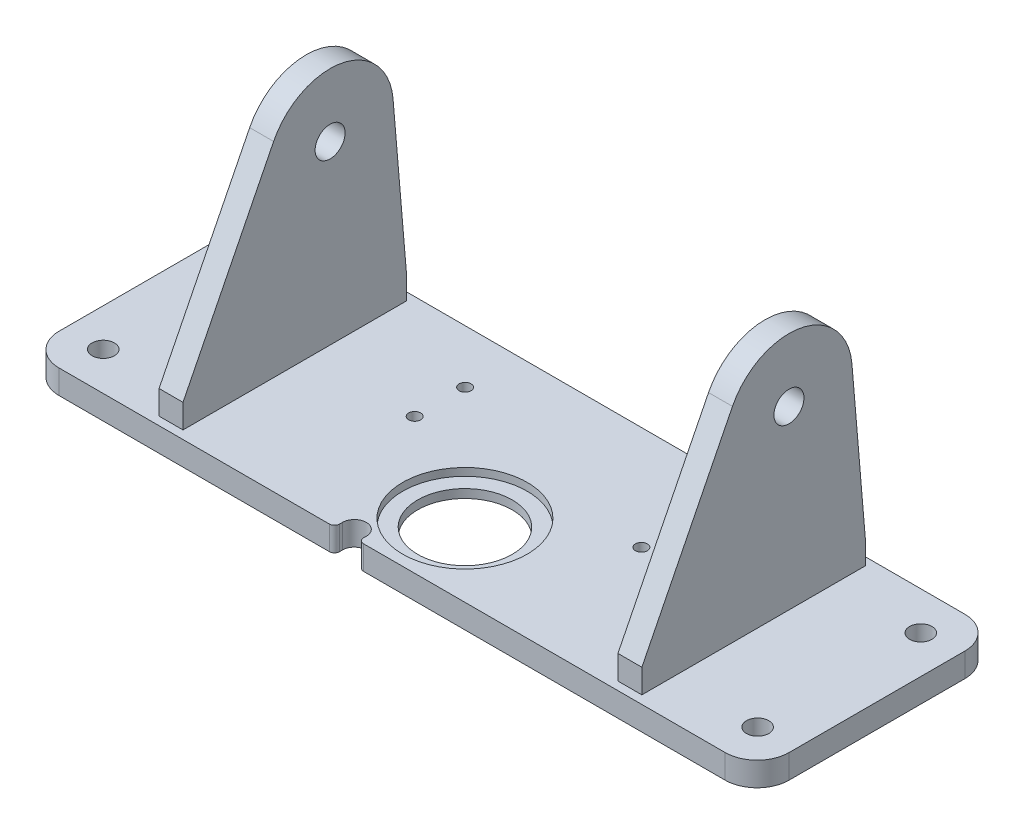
from build123d import *

# Parameters (mm, degrees)
SKETCH1_W                         = 290.3982
SKETCH1_H                         = 95.3516
SKETCH1_R                         = 18.796
MOUNTING_PLATE_DEPTH              = 9.525
SKETCH3_R                         = 4.445
SKETCH3_R_2                       = 2.3876
MOUNTING_HOLES_DEPTH              = 154.122454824
CORNER_RADII_R                    = 12.7
SKETCH5_W                         = 9.525
SKETCH5_H                         = 95.3516
UPRIGHT_TABS_DEPTH                = 95.25
UPRIGHT_TABS_2_DEPTH              = 95.25
SKETCH6_R                         = 5.969
POLE_BOLT_HOLE_REAM_TO_SIZE_DEPTH = 268.299261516
FILLET3_R                         = 2.032
SKETCH7_R                         = 24.765
SEAL_BELLOW_BOTTOM_CUT_DEPTH      = 3.048
SEAL_START                        = -3.048
SKETCH8_R                         = 24.765
SEAL_BELLOW_TOP_CUT_DEPTH         = 3.048


with BuildPart() as part:
    # Sketch1 → Mounting Plate (new body)
    with BuildSketch(Plane(origin=(0, 0, 0), x_dir=(1, 0, 0), z_dir=(0, 1, 0))):
        Rectangle(SKETCH1_W, SKETCH1_H)
        with Locations(Location((0, -18.7198, 0), (0, 0, 90))):
            Circle(SKETCH1_R, mode=Mode.SUBTRACT)
    extrude(amount=MOUNTING_PLATE_DEPTH)

    # Sketch3 → Mounting holes (cut, through all)
    with BuildSketch(Plane(origin=(0, 9.525, 0), x_dir=(1, 0, 0), z_dir=(0, 1, 0))):
        with Locations(Location((-130.175, 32.4612, 0), (0, 0, 270))):
            Circle(SKETCH3_R)
        with Locations(Location((130.175, 32.4612, 0), (0, 0, 270))):
            Circle(SKETCH3_R)
        with Locations(Location((130.175, -32.4612, 0), (0, 0, 270))):
            Circle(SKETCH3_R)
        with Locations(Location((-130.175, -32.4612, 0), (0, 0, 270))):
            Circle(SKETCH3_R)
        with Locations(Location((45.10405, 26.4414, 0), (0, 0, 270))):
            Circle(SKETCH3_R_2)
        with Locations(Location((45.10405, 6.3754, 0), (0, 0, 270))):
            Circle(SKETCH3_R_2)
        with Locations(Location((-45.10405, 6.3754, 0), (0, 0, 270))):
            Circle(SKETCH3_R_2)
        with Locations(Location((-45.10405, 26.4414, 0), (0, 0, 270))):
            Circle(SKETCH3_R_2)
        with BuildLine():
            Line((-22.9616, -44.5008), (-22.9616, -47.6758))
            Line((-22.9616, -47.6758), (-13.4366, -47.6758))
            Line((-13.4366, -47.6758), (-13.4366, -44.5008))
            ThreePointArc((-13.4366, -44.5008), (-18.1991, -39.7383), (-22.9616, -44.5008))
        make_face()
    extrude(amount=-MOUNTING_HOLES_DEPTH, mode=Mode.SUBTRACT)

    # corner radii
    corner_radii_edges = [part.edges().sort_by_distance(p)[0] for p in [
        (145.1991, 4.7625, 47.6758),
        (-145.1991, 4.7625, 47.6758),
        (-145.1991, 4.7625, -47.6758),
        (145.1991, 4.7625, -47.6758),
    ]]
    fillet(corner_radii_edges, radius=CORNER_RADII_R)

    # Fillet3
    fillet3_edges = [part.edges().sort_by_distance(p)[0] for p in [
        (-13.4366, 4.7625, 47.6758),
        (-22.9616, 4.7625, 47.6758),
    ]]
    fillet(fillet3_edges, radius=FILLET3_R)

    # Sketch7 → seal bellow bottom cut (cut)
    with BuildSketch(Plane.XZ):
        with Locations(Location((0, 18.7198, 0), (0, 0, 270))):
            Circle(SKETCH7_R)
    extrude(amount=-SEAL_BELLOW_BOTTOM_CUT_DEPTH, mode=Mode.SUBTRACT)

    # Sketch8 → seal bellow top cut (cut)
    with BuildSketch(Plane(origin=(0, 9.525, 0), x_dir=(1, 0, 0), z_dir=(0, 1, 0)).offset(SEAL_START)):
        with Locations(Location((0, -18.7198, 0), (0, 0, 90))):
            Circle(SKETCH8_R)
    extrude(amount=SEAL_BELLOW_TOP_CUT_DEPTH, mode=Mode.SUBTRACT)


with BuildPart() as body_2:
    # Sketch5 → Upright tabs (new body)
    with BuildSketch(Plane(origin=(0, 9.525, 0), x_dir=(1, 0, 0), z_dir=(0, 1, 0))):
        with Locations((-91.28125, 0)):
            Rectangle(SKETCH5_W, SKETCH5_H)
    extrude(amount=UPRIGHT_TABS_DEPTH)


with BuildPart() as body_3:
    # Sketch5 → Upright tabs 2 (new body)
    with BuildSketch(Plane(origin=(0, 9.525, 0), x_dir=(1, 0, 0), z_dir=(0, 1, 0))):
        with Locations((91.28125, 0)):
            Rectangle(SKETCH5_W, SKETCH5_H)
    extrude(amount=UPRIGHT_TABS_2_DEPTH)


with BuildPart() as pole_bolt_hole_ream_to_size_tool:
    # Sketch6 → Pole Bolt hole _ream to size (new, through all)
    with BuildSketch(Plane(origin=(96.04375, 0, 0), x_dir=(0, 0, -1), z_dir=(1, 0, 0))):
        with Locations((14.1478, 79.629)):
            Circle(SKETCH6_R)
        with BuildLine():
            Line((-44.3738, 19.05), (-8.328677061, 90.904162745))
            ThreePointArc((-8.328677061, 90.904162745), (18.900344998, 104.321805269), (39.203701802, 81.755758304))
            Line((39.203701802, 81.755758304), (44.5262, 19.05))
            Line((44.5262, 19.05), (44.5262, 9.525))
            Line((44.5262, 9.525), (47.6758, 9.525))
            Line((47.6758, 9.525), (47.6758, 110.612830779))
            Line((47.6758, 110.612830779), (-47.6758, 110.612830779))
            Line((-47.6758, 110.612830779), (-47.6758, 9.525))
            Line((-47.6758, 9.525), (-44.3738, 9.525))
            Line((-44.3738, 9.525), (-44.3738, 19.05))
        make_face()
    extrude(amount=-POLE_BOLT_HOLE_REAM_TO_SIZE_DEPTH)


with BuildPart() as body_2_1:
    add(body_2.part)

    # Pole Bolt hole _ream to size: cut by pole_bolt_hole_ream_to_size_tool
    add(pole_bolt_hole_ream_to_size_tool.part, mode=Mode.SUBTRACT)


with BuildPart() as body_3_1:
    add(body_3.part)

    # Pole Bolt hole _ream to size: cut by pole_bolt_hole_ream_to_size_tool
    add(pole_bolt_hole_ream_to_size_tool.part, mode=Mode.SUBTRACT)


solid = Compound([part.part, body_2_1.part, body_3_1.part])
